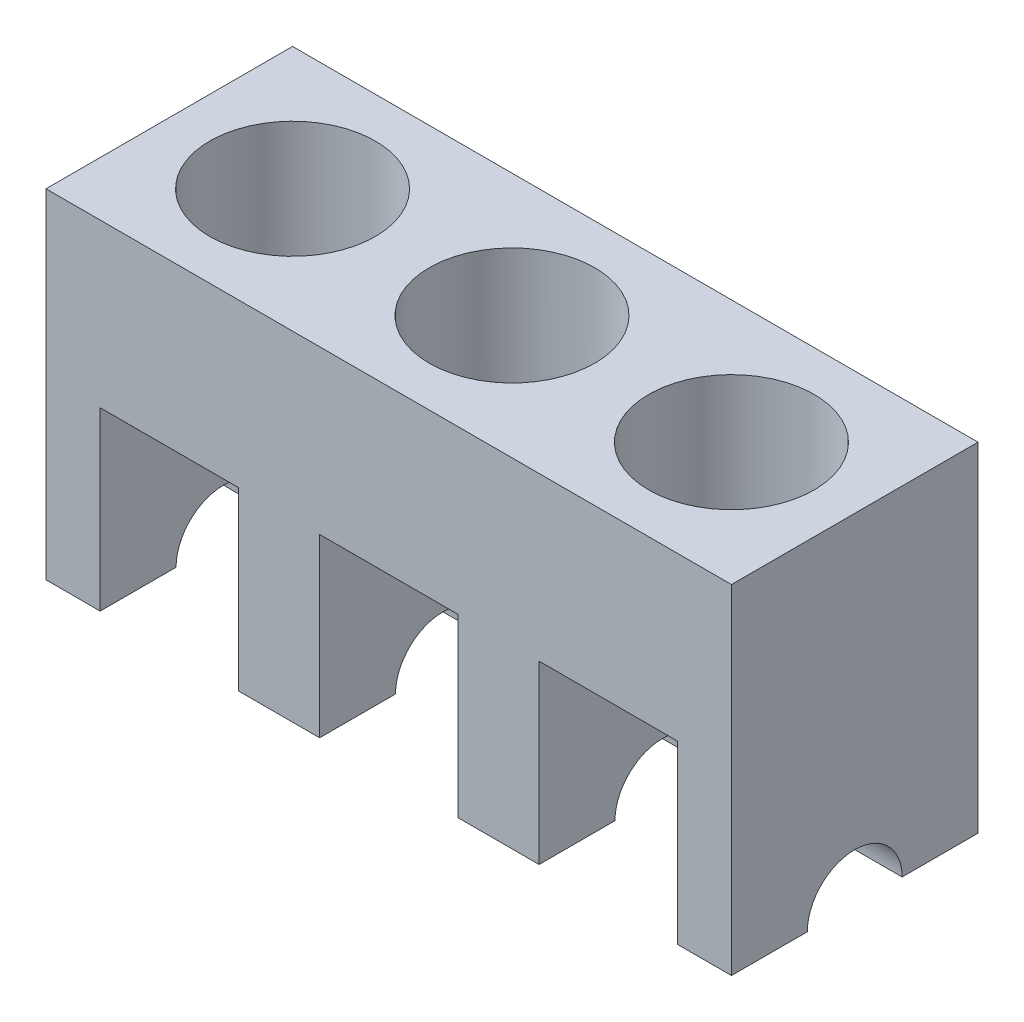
ISO-10303-21;
HEADER;
FILE_DESCRIPTION(('STEP AP214'),'2;1');
FILE_NAME('part.step','',(''),(''),'','','');
FILE_SCHEMA(('AUTOMOTIVE_DESIGN { 1 0 10303 214 1 1 1 1 }'));
ENDSEC;
DATA;
#1=APPLICATION_CONTEXT('core data for automotive mechanical design processes');
#2=APPLICATION_PROTOCOL_DEFINITION('international standard','automotive_design',2000,#1);
#3=PRODUCT_CONTEXT('',#1,'mechanical');
#4=PRODUCT('Part','Part','',(#3));
#5=PRODUCT_RELATED_PRODUCT_CATEGORY('part','',(#4));
#6=PRODUCT_DEFINITION_FORMATION('','',#4);
#7=PRODUCT_DEFINITION_CONTEXT('part definition',#1,'design');
#8=PRODUCT_DEFINITION('design','',#6,#7);
#9=PRODUCT_DEFINITION_SHAPE('','',#8);
#10=(LENGTH_UNIT() NAMED_UNIT(*) SI_UNIT(.MILLI.,.METRE.));
#11=(NAMED_UNIT(*) PLANE_ANGLE_UNIT() SI_UNIT($,.RADIAN.));
#12=(NAMED_UNIT(*) SI_UNIT($,.STERADIAN.) SOLID_ANGLE_UNIT());
#13=UNCERTAINTY_MEASURE_WITH_UNIT(LENGTH_MEASURE(1.E-05),#10,'distance_accuracy_value','');
#14=(GEOMETRIC_REPRESENTATION_CONTEXT(3) GLOBAL_UNCERTAINTY_ASSIGNED_CONTEXT((#13)) GLOBAL_UNIT_ASSIGNED_CONTEXT((#10,
#11,#12)) REPRESENTATION_CONTEXT('',''));
#15=CARTESIAN_POINT('',(0.,0.,0.));
#16=DIRECTION('',(0.,0.,1.));
#17=DIRECTION('',(1.,0.,0.));
#18=AXIS2_PLACEMENT_3D('',#15,#16,#17);
#19=CARTESIAN_POINT('',(0.,0.,0.));
#20=DIRECTION('',(0.,1.,0.));
#21=DIRECTION('',(0.,0.,1.));
#22=AXIS2_PLACEMENT_3D('',#19,#20,#21);
#23=PLANE('',#22);
#24=DIRECTION('',(0.,0.,-1.));
#25=VECTOR('',#24,1.);
#26=CARTESIAN_POINT('',(-55.5,0.,0.));
#27=LINE('',#26,#25);
#28=CARTESIAN_POINT('',(-55.5,0.,45.5));
#29=VERTEX_POINT('',#28);
#30=CARTESIAN_POINT('',(-55.5,0.,17.5));
#31=VERTEX_POINT('',#30);
#32=EDGE_CURVE('E421',#29,#31,#27,.T.);
#33=ORIENTED_EDGE('',*,*,#32,.T.);
#34=DIRECTION('',(1.,0.,0.));
#35=VECTOR('',#34,1.);
#36=CARTESIAN_POINT('',(-126.5,0.,17.5));
#37=LINE('',#36,#35);
#38=CARTESIAN_POINT('',(-25.5,0.,17.5));
#39=VERTEX_POINT('',#38);
#40=EDGE_CURVE('E623',#31,#39,#37,.T.);
#41=ORIENTED_EDGE('',*,*,#40,.T.);
#42=DIRECTION('',(0.,0.,1.));
#43=VECTOR('',#42,1.);
#44=CARTESIAN_POINT('',(-25.5,0.,0.));
#45=LINE('',#44,#43);
#46=CARTESIAN_POINT('',(-25.5,0.,45.5));
#47=VERTEX_POINT('',#46);
#48=EDGE_CURVE('E430',#39,#47,#45,.T.);
#49=ORIENTED_EDGE('',*,*,#48,.T.);
#50=DIRECTION('',(1.,0.,0.));
#51=VECTOR('',#50,1.);
#52=CARTESIAN_POINT('',(-126.5,0.,45.5));
#53=LINE('',#52,#51);
#54=EDGE_CURVE('E299',#29,#47,#53,.T.);
#55=ORIENTED_EDGE('',*,*,#54,.F.);
#56=EDGE_LOOP('',(#33,#41,#49,#55));
#57=FACE_BOUND('',#56,.T.);
#58=ADVANCED_FACE('F33',(#57),#23,.F.);
#59=DIRECTION('',(0.,0.,-1.));
#60=VECTOR('',#59,1.);
#61=CARTESIAN_POINT('',(106.5,0.,0.));
#62=LINE('',#61,#60);
#63=CARTESIAN_POINT('',(106.5,0.,45.5));
#64=VERTEX_POINT('',#63);
#65=CARTESIAN_POINT('',(106.5,0.,17.5));
#66=VERTEX_POINT('',#65);
#67=EDGE_CURVE('E455',#64,#66,#62,.T.);
#68=ORIENTED_EDGE('',*,*,#67,.T.);
#69=DIRECTION('',(1.,0.,0.));
#70=VECTOR('',#69,1.);
#71=CARTESIAN_POINT('',(-126.5,0.,17.5));
#72=LINE('',#71,#70);
#73=CARTESIAN_POINT('',(126.5,0.,17.5));
#74=VERTEX_POINT('',#73);
#75=EDGE_CURVE('E617',#66,#74,#72,.T.);
#76=ORIENTED_EDGE('',*,*,#75,.T.);
#77=DIRECTION('',(0.,0.,-1.));
#78=VECTOR('',#77,1.);
#79=CARTESIAN_POINT('',(126.5,0.,-45.5));
#80=LINE('',#79,#78);
#81=CARTESIAN_POINT('',(126.5,0.,45.5));
#82=VERTEX_POINT('',#81);
#83=EDGE_CURVE('E476',#82,#74,#80,.T.);
#84=ORIENTED_EDGE('',*,*,#83,.F.);
#85=EDGE_CURVE('E287',#64,#82,#53,.T.);
#86=ORIENTED_EDGE('',*,*,#85,.F.);
#87=EDGE_LOOP('',(#68,#76,#84,#86));
#88=FACE_BOUND('',#87,.T.);
#89=ADVANCED_FACE('F579',(#88),#23,.F.);
#90=DIRECTION('',(0.,0.,-1.));
#91=VECTOR('',#90,1.);
#92=CARTESIAN_POINT('',(25.5,0.,0.));
#93=LINE('',#92,#91);
#94=CARTESIAN_POINT('',(25.5,0.,45.5));
#95=VERTEX_POINT('',#94);
#96=CARTESIAN_POINT('',(25.5,0.,17.5));
#97=VERTEX_POINT('',#96);
#98=EDGE_CURVE('E441',#95,#97,#93,.T.);
#99=ORIENTED_EDGE('',*,*,#98,.T.);
#100=DIRECTION('',(1.,0.,0.));
#101=VECTOR('',#100,1.);
#102=CARTESIAN_POINT('',(-126.5,0.,17.5));
#103=LINE('',#102,#101);
#104=CARTESIAN_POINT('',(55.5,0.,17.5));
#105=VERTEX_POINT('',#104);
#106=EDGE_CURVE('E604',#97,#105,#103,.T.);
#107=ORIENTED_EDGE('',*,*,#106,.T.);
#108=DIRECTION('',(0.,0.,1.));
#109=VECTOR('',#108,1.);
#110=CARTESIAN_POINT('',(55.5,0.,0.));
#111=LINE('',#110,#109);
#112=CARTESIAN_POINT('',(55.5,0.,45.5));
#113=VERTEX_POINT('',#112);
#114=EDGE_CURVE('E447',#105,#113,#111,.T.);
#115=ORIENTED_EDGE('',*,*,#114,.T.);
#116=EDGE_CURVE('E290',#95,#113,#53,.T.);
#117=ORIENTED_EDGE('',*,*,#116,.F.);
#118=EDGE_LOOP('',(#99,#107,#115,#117));
#119=FACE_BOUND('',#118,.T.);
#120=ADVANCED_FACE('F585',(#119),#23,.F.);
#121=DIRECTION('',(0.,0.,1.));
#122=VECTOR('',#121,1.);
#123=CARTESIAN_POINT('',(-126.5,0.,-45.5));
#124=LINE('',#123,#122);
#125=CARTESIAN_POINT('',(-126.5,0.,17.5));
#126=VERTEX_POINT('',#125);
#127=CARTESIAN_POINT('',(-126.5,0.,45.5));
#128=VERTEX_POINT('',#127);
#129=EDGE_CURVE('E288',#126,#128,#124,.T.);
#130=ORIENTED_EDGE('',*,*,#129,.F.);
#131=DIRECTION('',(1.,0.,0.));
#132=VECTOR('',#131,1.);
#133=CARTESIAN_POINT('',(-126.5,0.,17.5));
#134=LINE('',#133,#132);
#135=CARTESIAN_POINT('',(-106.5,0.,17.5));
#136=VERTEX_POINT('',#135);
#137=EDGE_CURVE('E267',#126,#136,#134,.T.);
#138=ORIENTED_EDGE('',*,*,#137,.T.);
#139=DIRECTION('',(0.,0.,1.));
#140=VECTOR('',#139,1.);
#141=CARTESIAN_POINT('',(-106.5,0.,0.));
#142=LINE('',#141,#140);
#143=CARTESIAN_POINT('',(-106.5,0.,45.5));
#144=VERTEX_POINT('',#143);
#145=EDGE_CURVE('E412',#136,#144,#142,.T.);
#146=ORIENTED_EDGE('',*,*,#145,.T.);
#147=EDGE_CURVE('E292',#128,#144,#53,.T.);
#148=ORIENTED_EDGE('',*,*,#147,.F.);
#149=EDGE_LOOP('',(#130,#138,#146,#148));
#150=FACE_BOUND('',#149,.T.);
#151=ADVANCED_FACE('F675',(#150),#23,.F.);
#152=CARTESIAN_POINT('',(-25.5,0.,-45.5));
#153=VERTEX_POINT('',#152);
#154=CARTESIAN_POINT('',(-25.5,0.,-17.5));
#155=VERTEX_POINT('',#154);
#156=EDGE_CURVE('E431',#153,#155,#45,.T.);
#157=ORIENTED_EDGE('',*,*,#156,.T.);
#158=DIRECTION('',(1.,0.,0.));
#159=VECTOR('',#158,1.);
#160=CARTESIAN_POINT('',(-126.5,0.,-17.5));
#161=LINE('',#160,#159);
#162=CARTESIAN_POINT('',(-55.5,0.,-17.5));
#163=VERTEX_POINT('',#162);
#164=EDGE_CURVE('E56',#155,#163,#161,.F.);
#165=ORIENTED_EDGE('',*,*,#164,.T.);
#166=CARTESIAN_POINT('',(-55.5,0.,-45.5));
#167=VERTEX_POINT('',#166);
#168=EDGE_CURVE('E420',#163,#167,#27,.T.);
#169=ORIENTED_EDGE('',*,*,#168,.T.);
#170=DIRECTION('',(-1.,0.,0.));
#171=VECTOR('',#170,1.);
#172=CARTESIAN_POINT('',(-126.5,0.,-45.5));
#173=LINE('',#172,#171);
#174=EDGE_CURVE('E483',#153,#167,#173,.T.);
#175=ORIENTED_EDGE('',*,*,#174,.F.);
#176=EDGE_LOOP('',(#157,#165,#169,#175));
#177=FACE_BOUND('',#176,.T.);
#178=ADVANCED_FACE('F509',(#177),#23,.F.);
#179=CARTESIAN_POINT('',(126.5,0.,-17.5));
#180=VERTEX_POINT('',#179);
#181=CARTESIAN_POINT('',(126.5,0.,-45.5));
#182=VERTEX_POINT('',#181);
#183=EDGE_CURVE('E313',#180,#182,#80,.T.);
#184=ORIENTED_EDGE('',*,*,#183,.F.);
#185=DIRECTION('',(1.,0.,0.));
#186=VECTOR('',#185,1.);
#187=CARTESIAN_POINT('',(-126.5,0.,-17.5));
#188=LINE('',#187,#186);
#189=CARTESIAN_POINT('',(106.5,0.,-17.5));
#190=VERTEX_POINT('',#189);
#191=EDGE_CURVE('E615',#180,#190,#188,.F.);
#192=ORIENTED_EDGE('',*,*,#191,.T.);
#193=CARTESIAN_POINT('',(106.5,0.,-45.5));
#194=VERTEX_POINT('',#193);
#195=EDGE_CURVE('E454',#190,#194,#62,.T.);
#196=ORIENTED_EDGE('',*,*,#195,.T.);
#197=EDGE_CURVE('E293',#182,#194,#173,.T.);
#198=ORIENTED_EDGE('',*,*,#197,.F.);
#199=EDGE_LOOP('',(#184,#192,#196,#198));
#200=FACE_BOUND('',#199,.T.);
#201=ADVANCED_FACE('F496',(#200),#23,.F.);
#202=CARTESIAN_POINT('',(55.5,0.,-45.5));
#203=VERTEX_POINT('',#202);
#204=CARTESIAN_POINT('',(55.5,0.,-17.5));
#205=VERTEX_POINT('',#204);
#206=EDGE_CURVE('E448',#203,#205,#111,.T.);
#207=ORIENTED_EDGE('',*,*,#206,.T.);
#208=DIRECTION('',(1.,0.,0.));
#209=VECTOR('',#208,1.);
#210=CARTESIAN_POINT('',(-126.5,0.,-17.5));
#211=LINE('',#210,#209);
#212=CARTESIAN_POINT('',(25.5,0.,-17.5));
#213=VERTEX_POINT('',#212);
#214=EDGE_CURVE('E271',#205,#213,#211,.F.);
#215=ORIENTED_EDGE('',*,*,#214,.T.);
#216=CARTESIAN_POINT('',(25.5,0.,-45.5));
#217=VERTEX_POINT('',#216);
#218=EDGE_CURVE('E440',#213,#217,#93,.T.);
#219=ORIENTED_EDGE('',*,*,#218,.T.);
#220=EDGE_CURVE('E499',#203,#217,#173,.T.);
#221=ORIENTED_EDGE('',*,*,#220,.F.);
#222=EDGE_LOOP('',(#207,#215,#219,#221));
#223=FACE_BOUND('',#222,.T.);
#224=ADVANCED_FACE('F576',(#223),#23,.F.);
#225=CARTESIAN_POINT('',(81.,44.,0.));
#226=DIRECTION('',(0.,1.,0.));
#227=DIRECTION('',(0.,0.,1.));
#228=AXIS2_PLACEMENT_3D('',#225,#226,#227);
#229=PLANE('',#228);
#230=DIRECTION('',(0.,0.,-1.));
#231=VECTOR('',#230,1.);
#232=CARTESIAN_POINT('',(106.5,44.,0.));
#233=LINE('',#232,#231);
#234=CARTESIAN_POINT('',(106.5,44.,16.8241641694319));
#235=VERTEX_POINT('',#234);
#236=CARTESIAN_POINT('',(106.5,44.,-16.824164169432));
#237=VERTEX_POINT('',#236);
#238=EDGE_CURVE('E338',#235,#237,#233,.T.);
#239=ORIENTED_EDGE('',*,*,#238,.F.);
#240=CARTESIAN_POINT('',(81.,44.,0.));
#241=DIRECTION('',(0.,1.,0.));
#242=DIRECTION('',(0.,0.,1.));
#243=AXIS2_PLACEMENT_3D('',#240,#241,#242);
#244=CIRCLE('',#243,30.55);
#245=EDGE_CURVE('E472',#235,#237,#244,.T.);
#246=ORIENTED_EDGE('',*,*,#245,.T.);
#247=EDGE_LOOP('',(#239,#246));
#248=FACE_BOUND('',#247,.T.);
#249=ADVANCED_FACE('F564',(#248),#229,.T.);
#250=CARTESIAN_POINT('',(0.,44.,0.));
#251=DIRECTION('',(0.,1.,0.));
#252=DIRECTION('',(0.,0.,1.));
#253=AXIS2_PLACEMENT_3D('',#250,#251,#252);
#254=PLANE('',#253);
#255=DIRECTION('',(0.,0.,-1.));
#256=VECTOR('',#255,1.);
#257=CARTESIAN_POINT('',(25.5,44.,0.));
#258=LINE('',#257,#256);
#259=CARTESIAN_POINT('',(25.5,44.,16.824164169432));
#260=VERTEX_POINT('',#259);
#261=CARTESIAN_POINT('',(25.5,44.,-16.824164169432));
#262=VERTEX_POINT('',#261);
#263=EDGE_CURVE('E330',#260,#262,#258,.T.);
#264=ORIENTED_EDGE('',*,*,#263,.F.);
#265=CARTESIAN_POINT('',(0.,44.,0.));
#266=DIRECTION('',(0.,1.,0.));
#267=DIRECTION('',(0.,0.,1.));
#268=AXIS2_PLACEMENT_3D('',#265,#266,#267);
#269=CIRCLE('',#268,30.55);
#270=EDGE_CURVE('E465',#260,#262,#269,.T.);
#271=ORIENTED_EDGE('',*,*,#270,.T.);
#272=EDGE_LOOP('',(#264,#271));
#273=FACE_BOUND('',#272,.T.);
#274=ADVANCED_FACE('F575',(#273),#254,.T.);
#275=CARTESIAN_POINT('',(-81.,44.,0.));
#276=DIRECTION('',(0.,1.,0.));
#277=DIRECTION('',(0.,0.,1.));
#278=AXIS2_PLACEMENT_3D('',#275,#276,#277);
#279=PLANE('',#278);
#280=DIRECTION('',(0.,0.,-1.));
#281=VECTOR('',#280,1.);
#282=CARTESIAN_POINT('',(-55.5,44.,0.));
#283=LINE('',#282,#281);
#284=CARTESIAN_POINT('',(-55.5,44.,16.824164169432));
#285=VERTEX_POINT('',#284);
#286=CARTESIAN_POINT('',(-55.5,44.,-16.824164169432));
#287=VERTEX_POINT('',#286);
#288=EDGE_CURVE('E322',#285,#287,#283,.T.);
#289=ORIENTED_EDGE('',*,*,#288,.F.);
#290=CARTESIAN_POINT('',(-81.,44.,0.));
#291=DIRECTION('',(0.,1.,0.));
#292=DIRECTION('',(0.,0.,1.));
#293=AXIS2_PLACEMENT_3D('',#290,#291,#292);
#294=CIRCLE('',#293,30.55);
#295=EDGE_CURVE('E304',#285,#287,#294,.T.);
#296=ORIENTED_EDGE('',*,*,#295,.T.);
#297=EDGE_LOOP('',(#289,#296));
#298=FACE_BOUND('',#297,.T.);
#299=ADVANCED_FACE('F654',(#298),#279,.T.);
#300=CARTESIAN_POINT('',(126.5,0.,-45.5));
#301=DIRECTION('',(1.,0.,0.));
#302=DIRECTION('',(0.,0.,-1.));
#303=AXIS2_PLACEMENT_3D('',#300,#301,#302);
#304=PLANE('',#303);
#305=CARTESIAN_POINT('',(126.5,0.,0.));
#306=DIRECTION('',(1.,0.,0.));
#307=DIRECTION('',(0.,0.,-1.));
#308=AXIS2_PLACEMENT_3D('',#305,#306,#307);
#309=CIRCLE('',#308,17.5);
#310=EDGE_CURVE('E272',#180,#74,#309,.T.);
#311=ORIENTED_EDGE('',*,*,#310,.F.);
#312=ORIENTED_EDGE('',*,*,#183,.T.);
#313=DIRECTION('',(0.,1.,0.));
#314=VECTOR('',#313,1.);
#315=CARTESIAN_POINT('',(126.5,0.,-45.5));
#316=LINE('',#315,#314);
#317=CARTESIAN_POINT('',(126.5,125.,-45.5));
#318=VERTEX_POINT('',#317);
#319=EDGE_CURVE('E298',#182,#318,#316,.T.);
#320=ORIENTED_EDGE('',*,*,#319,.T.);
#321=DIRECTION('',(0.,0.,-1.));
#322=VECTOR('',#321,1.);
#323=CARTESIAN_POINT('',(126.5,125.,-45.5));
#324=LINE('',#323,#322);
#325=CARTESIAN_POINT('',(126.5,125.,45.5));
#326=VERTEX_POINT('',#325);
#327=EDGE_CURVE('E300',#326,#318,#324,.T.);
#328=ORIENTED_EDGE('',*,*,#327,.F.);
#329=DIRECTION('',(0.,1.,0.));
#330=VECTOR('',#329,1.);
#331=CARTESIAN_POINT('',(126.5,0.,45.5));
#332=LINE('',#331,#330);
#333=EDGE_CURVE('E314',#82,#326,#332,.T.);
#334=ORIENTED_EDGE('',*,*,#333,.F.);
#335=ORIENTED_EDGE('',*,*,#83,.T.);
#336=EDGE_LOOP('',(#311,#312,#320,#328,#334,#335));
#337=FACE_BOUND('',#336,.T.);
#338=ADVANCED_FACE('F35',(#337),#304,.T.);
#339=CARTESIAN_POINT('',(-126.5,0.,45.5));
#340=DIRECTION('',(0.,0.,1.));
#341=DIRECTION('',(1.,0.,0.));
#342=AXIS2_PLACEMENT_3D('',#339,#340,#341);
#343=PLANE('',#342);
#344=DIRECTION('',(0.,1.,0.));
#345=VECTOR('',#344,1.);
#346=CARTESIAN_POINT('',(-55.5,65.,45.5));
#347=LINE('',#346,#345);
#348=CARTESIAN_POINT('',(-55.5,65.,45.5));
#349=VERTEX_POINT('',#348);
#350=EDGE_CURVE('E369',#29,#349,#347,.T.);
#351=ORIENTED_EDGE('',*,*,#350,.F.);
#352=ORIENTED_EDGE('',*,*,#54,.T.);
#353=DIRECTION('',(0.,-1.,0.));
#354=VECTOR('',#353,1.);
#355=CARTESIAN_POINT('',(-25.5,65.,45.5));
#356=LINE('',#355,#354);
#357=CARTESIAN_POINT('',(-25.5,65.,45.5));
#358=VERTEX_POINT('',#357);
#359=EDGE_CURVE('E384',#358,#47,#356,.T.);
#360=ORIENTED_EDGE('',*,*,#359,.F.);
#361=DIRECTION('',(-1.,0.,0.));
#362=VECTOR('',#361,1.);
#363=CARTESIAN_POINT('',(-25.5,65.,45.5));
#364=LINE('',#363,#362);
#365=CARTESIAN_POINT('',(25.5,65.,45.5));
#366=VERTEX_POINT('',#365);
#367=EDGE_CURVE('E381',#366,#358,#364,.T.);
#368=ORIENTED_EDGE('',*,*,#367,.F.);
#369=DIRECTION('',(0.,1.,0.));
#370=VECTOR('',#369,1.);
#371=CARTESIAN_POINT('',(25.5,65.,45.5));
#372=LINE('',#371,#370);
#373=EDGE_CURVE('E379',#95,#366,#372,.T.);
#374=ORIENTED_EDGE('',*,*,#373,.F.);
#375=ORIENTED_EDGE('',*,*,#116,.T.);
#376=DIRECTION('',(0.,-1.,0.));
#377=VECTOR('',#376,1.);
#378=CARTESIAN_POINT('',(55.5,65.,45.5));
#379=LINE('',#378,#377);
#380=CARTESIAN_POINT('',(55.5,65.,45.5));
#381=VERTEX_POINT('',#380);
#382=EDGE_CURVE('E537',#381,#113,#379,.T.);
#383=ORIENTED_EDGE('',*,*,#382,.F.);
#384=DIRECTION('',(-1.,0.,0.));
#385=VECTOR('',#384,1.);
#386=CARTESIAN_POINT('',(55.5,65.,45.5));
#387=LINE('',#386,#385);
#388=CARTESIAN_POINT('',(106.5,65.,45.5));
#389=VERTEX_POINT('',#388);
#390=EDGE_CURVE('E534',#389,#381,#387,.T.);
#391=ORIENTED_EDGE('',*,*,#390,.F.);
#392=DIRECTION('',(0.,1.,0.));
#393=VECTOR('',#392,1.);
#394=CARTESIAN_POINT('',(106.5,65.,45.5));
#395=LINE('',#394,#393);
#396=EDGE_CURVE('E400',#64,#389,#395,.T.);
#397=ORIENTED_EDGE('',*,*,#396,.F.);
#398=ORIENTED_EDGE('',*,*,#85,.T.);
#399=ORIENTED_EDGE('',*,*,#333,.T.);
#400=DIRECTION('',(1.,0.,0.));
#401=VECTOR('',#400,1.);
#402=CARTESIAN_POINT('',(-126.5,125.,45.5));
#403=LINE('',#402,#401);
#404=CARTESIAN_POINT('',(-126.5,125.,45.5));
#405=VERTEX_POINT('',#404);
#406=EDGE_CURVE('E310',#405,#326,#403,.T.);
#407=ORIENTED_EDGE('',*,*,#406,.F.);
#408=DIRECTION('',(0.,1.,0.));
#409=VECTOR('',#408,1.);
#410=CARTESIAN_POINT('',(-126.5,0.,45.5));
#411=LINE('',#410,#409);
#412=EDGE_CURVE('E317',#128,#405,#411,.T.);
#413=ORIENTED_EDGE('',*,*,#412,.F.);
#414=ORIENTED_EDGE('',*,*,#147,.T.);
#415=DIRECTION('',(0.,-1.,0.));
#416=VECTOR('',#415,1.);
#417=CARTESIAN_POINT('',(-106.5,65.,45.5));
#418=LINE('',#417,#416);
#419=CARTESIAN_POINT('',(-106.5,65.,45.5));
#420=VERTEX_POINT('',#419);
#421=EDGE_CURVE('E518',#420,#144,#418,.T.);
#422=ORIENTED_EDGE('',*,*,#421,.F.);
#423=DIRECTION('',(-1.,0.,0.));
#424=VECTOR('',#423,1.);
#425=CARTESIAN_POINT('',(-106.5,65.,45.5));
#426=LINE('',#425,#424);
#427=EDGE_CURVE('E372',#349,#420,#426,.T.);
#428=ORIENTED_EDGE('',*,*,#427,.F.);
#429=EDGE_LOOP('',(#351,#352,#360,#368,#374,#375,#383,#391,#397,#398,#399,#407,#413,#414,#422,#428));
#430=FACE_BOUND('',#429,.T.);
#431=ADVANCED_FACE('F553',(#430),#343,.T.);
#432=CARTESIAN_POINT('',(-126.5,0.,-45.5));
#433=DIRECTION('',(-1.,0.,0.));
#434=DIRECTION('',(0.,0.,1.));
#435=AXIS2_PLACEMENT_3D('',#432,#433,#434);
#436=PLANE('',#435);
#437=CARTESIAN_POINT('',(-126.5,0.,0.));
#438=DIRECTION('',(1.,0.,0.));
#439=DIRECTION('',(0.,0.,-1.));
#440=AXIS2_PLACEMENT_3D('',#437,#438,#439);
#441=CIRCLE('',#440,17.5);
#442=CARTESIAN_POINT('',(-126.5,0.,-17.5));
#443=VERTEX_POINT('',#442);
#444=EDGE_CURVE('E264',#443,#126,#441,.T.);
#445=ORIENTED_EDGE('',*,*,#444,.T.);
#446=ORIENTED_EDGE('',*,*,#129,.T.);
#447=ORIENTED_EDGE('',*,*,#412,.T.);
#448=DIRECTION('',(0.,0.,1.));
#449=VECTOR('',#448,1.);
#450=CARTESIAN_POINT('',(-126.5,125.,-45.5));
#451=LINE('',#450,#449);
#452=CARTESIAN_POINT('',(-126.5,125.,-45.5));
#453=VERTEX_POINT('',#452);
#454=EDGE_CURVE('E307',#453,#405,#451,.T.);
#455=ORIENTED_EDGE('',*,*,#454,.F.);
#456=DIRECTION('',(0.,1.,0.));
#457=VECTOR('',#456,1.);
#458=CARTESIAN_POINT('',(-126.5,0.,-45.5));
#459=LINE('',#458,#457);
#460=CARTESIAN_POINT('',(-126.5,0.,-45.5));
#461=VERTEX_POINT('',#460);
#462=EDGE_CURVE('E286',#461,#453,#459,.T.);
#463=ORIENTED_EDGE('',*,*,#462,.F.);
#464=EDGE_CURVE('E279',#461,#443,#124,.T.);
#465=ORIENTED_EDGE('',*,*,#464,.T.);
#466=EDGE_LOOP('',(#445,#446,#447,#455,#463,#465));
#467=FACE_BOUND('',#466,.T.);
#468=ADVANCED_FACE('F284',(#467),#436,.T.);
#469=CARTESIAN_POINT('',(-126.5,0.,-45.5));
#470=DIRECTION('',(0.,0.,-1.));
#471=DIRECTION('',(-1.,0.,0.));
#472=AXIS2_PLACEMENT_3D('',#469,#470,#471);
#473=PLANE('',#472);
#474=DIRECTION('',(0.,1.,0.));
#475=VECTOR('',#474,1.);
#476=CARTESIAN_POINT('',(-55.5,65.,-45.5));
#477=LINE('',#476,#475);
#478=CARTESIAN_POINT('',(-55.5,65.,-45.5));
#479=VERTEX_POINT('',#478);
#480=EDGE_CURVE('E506',#167,#479,#477,.T.);
#481=ORIENTED_EDGE('',*,*,#480,.T.);
#482=DIRECTION('',(-1.,0.,0.));
#483=VECTOR('',#482,1.);
#484=CARTESIAN_POINT('',(-106.5,65.,-45.5));
#485=LINE('',#484,#483);
#486=CARTESIAN_POINT('',(-106.5,65.,-45.5));
#487=VERTEX_POINT('',#486);
#488=EDGE_CURVE('E517',#479,#487,#485,.T.);
#489=ORIENTED_EDGE('',*,*,#488,.T.);
#490=DIRECTION('',(0.,-1.,0.));
#491=VECTOR('',#490,1.);
#492=CARTESIAN_POINT('',(-106.5,65.,-45.5));
#493=LINE('',#492,#491);
#494=CARTESIAN_POINT('',(-106.5,0.,-45.5));
#495=VERTEX_POINT('',#494);
#496=EDGE_CURVE('E520',#487,#495,#493,.T.);
#497=ORIENTED_EDGE('',*,*,#496,.T.);
#498=EDGE_CURVE('E478',#495,#461,#173,.T.);
#499=ORIENTED_EDGE('',*,*,#498,.T.);
#500=ORIENTED_EDGE('',*,*,#462,.T.);
#501=DIRECTION('',(-1.,0.,0.));
#502=VECTOR('',#501,1.);
#503=CARTESIAN_POINT('',(-126.5,125.,-45.5));
#504=LINE('',#503,#502);
#505=EDGE_CURVE('E303',#318,#453,#504,.T.);
#506=ORIENTED_EDGE('',*,*,#505,.F.);
#507=ORIENTED_EDGE('',*,*,#319,.F.);
#508=ORIENTED_EDGE('',*,*,#197,.T.);
#509=DIRECTION('',(0.,1.,0.));
#510=VECTOR('',#509,1.);
#511=CARTESIAN_POINT('',(106.5,65.,-45.5));
#512=LINE('',#511,#510);
#513=CARTESIAN_POINT('',(106.5,65.,-45.5));
#514=VERTEX_POINT('',#513);
#515=EDGE_CURVE('E540',#194,#514,#512,.T.);
#516=ORIENTED_EDGE('',*,*,#515,.T.);
#517=DIRECTION('',(-1.,0.,0.));
#518=VECTOR('',#517,1.);
#519=CARTESIAN_POINT('',(55.5,65.,-45.5));
#520=LINE('',#519,#518);
#521=CARTESIAN_POINT('',(55.5,65.,-45.5));
#522=VERTEX_POINT('',#521);
#523=EDGE_CURVE('E541',#514,#522,#520,.T.);
#524=ORIENTED_EDGE('',*,*,#523,.T.);
#525=DIRECTION('',(0.,-1.,0.));
#526=VECTOR('',#525,1.);
#527=CARTESIAN_POINT('',(55.5,65.,-45.5));
#528=LINE('',#527,#526);
#529=EDGE_CURVE('E367',#522,#203,#528,.T.);
#530=ORIENTED_EDGE('',*,*,#529,.T.);
#531=ORIENTED_EDGE('',*,*,#220,.T.);
#532=DIRECTION('',(0.,1.,0.));
#533=VECTOR('',#532,1.);
#534=CARTESIAN_POINT('',(25.5,65.,-45.5));
#535=LINE('',#534,#533);
#536=CARTESIAN_POINT('',(25.5,65.,-45.5));
#537=VERTEX_POINT('',#536);
#538=EDGE_CURVE('E387',#217,#537,#535,.T.);
#539=ORIENTED_EDGE('',*,*,#538,.T.);
#540=DIRECTION('',(-1.,0.,0.));
#541=VECTOR('',#540,1.);
#542=CARTESIAN_POINT('',(-25.5,65.,-45.5));
#543=LINE('',#542,#541);
#544=CARTESIAN_POINT('',(-25.5,65.,-45.5));
#545=VERTEX_POINT('',#544);
#546=EDGE_CURVE('E390',#537,#545,#543,.T.);
#547=ORIENTED_EDGE('',*,*,#546,.T.);
#548=DIRECTION('',(0.,-1.,0.));
#549=VECTOR('',#548,1.);
#550=CARTESIAN_POINT('',(-25.5,65.,-45.5));
#551=LINE('',#550,#549);
#552=EDGE_CURVE('E393',#545,#153,#551,.T.);
#553=ORIENTED_EDGE('',*,*,#552,.T.);
#554=ORIENTED_EDGE('',*,*,#174,.T.);
#555=EDGE_LOOP('',(#481,#489,#497,#499,#500,#506,#507,#508,#516,#524,#530,#531,#539,#547,#553,#554));
#556=FACE_BOUND('',#555,.T.);
#557=ADVANCED_FACE('F494',(#556),#473,.T.);
#558=CARTESIAN_POINT('',(-106.5,0.,-17.5));
#559=VERTEX_POINT('',#558);
#560=EDGE_CURVE('E280',#495,#559,#142,.T.);
#561=ORIENTED_EDGE('',*,*,#560,.T.);
#562=DIRECTION('',(1.,0.,0.));
#563=VECTOR('',#562,1.);
#564=CARTESIAN_POINT('',(-126.5,0.,-17.5));
#565=LINE('',#564,#563);
#566=EDGE_CURVE('E48',#559,#443,#565,.F.);
#567=ORIENTED_EDGE('',*,*,#566,.T.);
#568=ORIENTED_EDGE('',*,*,#464,.F.);
#569=ORIENTED_EDGE('',*,*,#498,.F.);
#570=EDGE_LOOP('',(#561,#567,#568,#569));
#571=FACE_BOUND('',#570,.T.);
#572=ADVANCED_FACE('F277',(#571),#23,.F.);
#573=CARTESIAN_POINT('',(0.,125.,0.));
#574=DIRECTION('',(0.,1.,0.));
#575=DIRECTION('',(0.,0.,1.));
#576=AXIS2_PLACEMENT_3D('',#573,#574,#575);
#577=PLANE('',#576);
#578=CARTESIAN_POINT('',(-81.,125.,0.));
#579=DIRECTION('',(0.,1.,0.));
#580=DIRECTION('',(0.,0.,1.));
#581=AXIS2_PLACEMENT_3D('',#578,#579,#580);
#582=CIRCLE('',#581,30.55);
#583=CARTESIAN_POINT('',(-81.,125.,30.55));
#584=VERTEX_POINT('',#583);
#585=EDGE_CURVE('E462',#584,#584,#582,.T.);
#586=ORIENTED_EDGE('',*,*,#585,.F.);
#587=EDGE_LOOP('',(#586));
#588=FACE_BOUND('',#587,.T.);
#589=CARTESIAN_POINT('',(0.,125.,0.));
#590=DIRECTION('',(0.,1.,0.));
#591=DIRECTION('',(0.,0.,1.));
#592=AXIS2_PLACEMENT_3D('',#589,#590,#591);
#593=CIRCLE('',#592,30.55);
#594=CARTESIAN_POINT('',(0.,125.,30.55));
#595=VERTEX_POINT('',#594);
#596=EDGE_CURVE('E469',#595,#595,#593,.T.);
#597=ORIENTED_EDGE('',*,*,#596,.F.);
#598=EDGE_LOOP('',(#597));
#599=FACE_BOUND('',#598,.T.);
#600=CARTESIAN_POINT('',(81.,125.,0.));
#601=DIRECTION('',(0.,1.,0.));
#602=DIRECTION('',(0.,0.,1.));
#603=AXIS2_PLACEMENT_3D('',#600,#601,#602);
#604=CIRCLE('',#603,30.55);
#605=CARTESIAN_POINT('',(81.,125.,30.55));
#606=VERTEX_POINT('',#605);
#607=EDGE_CURVE('E458',#606,#606,#604,.T.);
#608=ORIENTED_EDGE('',*,*,#607,.F.);
#609=EDGE_LOOP('',(#608));
#610=FACE_BOUND('',#609,.T.);
#611=ORIENTED_EDGE('',*,*,#327,.T.);
#612=ORIENTED_EDGE('',*,*,#505,.T.);
#613=ORIENTED_EDGE('',*,*,#454,.T.);
#614=ORIENTED_EDGE('',*,*,#406,.T.);
#615=EDGE_LOOP('',(#611,#612,#613,#614));
#616=FACE_BOUND('',#615,.T.);
#617=ADVANCED_FACE('F572',(#588,#599,#610,#616),#577,.T.);
#618=CARTESIAN_POINT('',(81.,44.,0.));
#619=DIRECTION('',(0.,1.,0.));
#620=DIRECTION('',(0.,0.,1.));
#621=AXIS2_PLACEMENT_3D('',#618,#619,#620);
#622=CYLINDRICAL_SURFACE('',#621,30.55);
#623=CARTESIAN_POINT('',(81.,65.,0.));
#624=DIRECTION('',(0.,1.,0.));
#625=DIRECTION('',(0.,0.,1.));
#626=AXIS2_PLACEMENT_3D('',#623,#624,#625);
#627=CIRCLE('',#626,30.55);
#628=CARTESIAN_POINT('',(55.5,65.,-16.8241641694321));
#629=VERTEX_POINT('',#628);
#630=CARTESIAN_POINT('',(106.5,65.,-16.824164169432));
#631=VERTEX_POINT('',#630);
#632=EDGE_CURVE('E41',#629,#631,#627,.F.);
#633=ORIENTED_EDGE('',*,*,#632,.T.);
#634=DIRECTION('',(0.,1.,0.));
#635=VECTOR('',#634,1.);
#636=CARTESIAN_POINT('',(106.5,44.,-16.824164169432));
#637=LINE('',#636,#635);
#638=EDGE_CURVE('E350',#631,#237,#637,.F.);
#639=ORIENTED_EDGE('',*,*,#638,.T.);
#640=ORIENTED_EDGE('',*,*,#245,.F.);
#641=DIRECTION('',(0.,1.,0.));
#642=VECTOR('',#641,1.);
#643=CARTESIAN_POINT('',(106.5,44.,16.8241641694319));
#644=LINE('',#643,#642);
#645=CARTESIAN_POINT('',(106.5,65.,16.8241641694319));
#646=VERTEX_POINT('',#645);
#647=EDGE_CURVE('E451',#235,#646,#644,.T.);
#648=ORIENTED_EDGE('',*,*,#647,.T.);
#649=CARTESIAN_POINT('',(55.5,65.,16.824164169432));
#650=VERTEX_POINT('',#649);
#651=EDGE_CURVE('E339',#646,#650,#627,.F.);
#652=ORIENTED_EDGE('',*,*,#651,.T.);
#653=DIRECTION('',(0.,1.,0.));
#654=VECTOR('',#653,1.);
#655=CARTESIAN_POINT('',(55.5,44.,16.824164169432));
#656=LINE('',#655,#654);
#657=CARTESIAN_POINT('',(55.5,44.,16.824164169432));
#658=VERTEX_POINT('',#657);
#659=EDGE_CURVE('E445',#650,#658,#656,.F.);
#660=ORIENTED_EDGE('',*,*,#659,.T.);
#661=CARTESIAN_POINT('',(55.5,44.,-16.8241641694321));
#662=VERTEX_POINT('',#661);
#663=EDGE_CURVE('E474',#662,#658,#244,.T.);
#664=ORIENTED_EDGE('',*,*,#663,.F.);
#665=DIRECTION('',(0.,1.,0.));
#666=VECTOR('',#665,1.);
#667=CARTESIAN_POINT('',(55.5,44.,-16.8241641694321));
#668=LINE('',#667,#666);
#669=EDGE_CURVE('E353',#662,#629,#668,.T.);
#670=ORIENTED_EDGE('',*,*,#669,.T.);
#671=EDGE_LOOP('',(#633,#639,#640,#648,#652,#660,#664,#670));
#672=FACE_BOUND('',#671,.T.);
#673=ORIENTED_EDGE('',*,*,#607,.T.);
#674=EDGE_LOOP('',(#673));
#675=FACE_BOUND('',#674,.T.);
#676=ADVANCED_FACE('F347',(#672,#675),#622,.F.);
#677=DIRECTION('',(0.,0.,1.));
#678=VECTOR('',#677,1.);
#679=CARTESIAN_POINT('',(55.5,44.,0.));
#680=LINE('',#679,#678);
#681=EDGE_CURVE('E336',#662,#658,#680,.T.);
#682=ORIENTED_EDGE('',*,*,#681,.F.);
#683=ORIENTED_EDGE('',*,*,#663,.T.);
#684=EDGE_LOOP('',(#682,#683));
#685=FACE_BOUND('',#684,.T.);
#686=ADVANCED_FACE('F560',(#685),#229,.T.);
#687=CARTESIAN_POINT('',(0.,44.,0.));
#688=DIRECTION('',(0.,1.,0.));
#689=DIRECTION('',(0.,0.,1.));
#690=AXIS2_PLACEMENT_3D('',#687,#688,#689);
#691=CYLINDRICAL_SURFACE('',#690,30.55);
#692=CARTESIAN_POINT('',(0.,65.,0.));
#693=DIRECTION('',(0.,1.,0.));
#694=DIRECTION('',(0.,0.,1.));
#695=AXIS2_PLACEMENT_3D('',#692,#693,#694);
#696=CIRCLE('',#695,30.55);
#697=CARTESIAN_POINT('',(-25.5,65.,-16.8241641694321));
#698=VERTEX_POINT('',#697);
#699=CARTESIAN_POINT('',(25.5,65.,-16.824164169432));
#700=VERTEX_POINT('',#699);
#701=EDGE_CURVE('E335',#698,#700,#696,.F.);
#702=ORIENTED_EDGE('',*,*,#701,.T.);
#703=DIRECTION('',(0.,1.,0.));
#704=VECTOR('',#703,1.);
#705=CARTESIAN_POINT('',(25.5,44.,-16.824164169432));
#706=LINE('',#705,#704);
#707=EDGE_CURVE('E437',#700,#262,#706,.F.);
#708=ORIENTED_EDGE('',*,*,#707,.T.);
#709=ORIENTED_EDGE('',*,*,#270,.F.);
#710=DIRECTION('',(0.,1.,0.));
#711=VECTOR('',#710,1.);
#712=CARTESIAN_POINT('',(25.5,44.,16.824164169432));
#713=LINE('',#712,#711);
#714=CARTESIAN_POINT('',(25.5,65.,16.824164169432));
#715=VERTEX_POINT('',#714);
#716=EDGE_CURVE('E434',#260,#715,#713,.T.);
#717=ORIENTED_EDGE('',*,*,#716,.T.);
#718=CARTESIAN_POINT('',(-25.5,65.,16.8241641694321));
#719=VERTEX_POINT('',#718);
#720=EDGE_CURVE('E332',#715,#719,#696,.F.);
#721=ORIENTED_EDGE('',*,*,#720,.T.);
#722=DIRECTION('',(0.,1.,0.));
#723=VECTOR('',#722,1.);
#724=CARTESIAN_POINT('',(-25.5,44.,16.8241641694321));
#725=LINE('',#724,#723);
#726=CARTESIAN_POINT('',(-25.5,44.,16.8241641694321));
#727=VERTEX_POINT('',#726);
#728=EDGE_CURVE('E427',#719,#727,#725,.F.);
#729=ORIENTED_EDGE('',*,*,#728,.T.);
#730=CARTESIAN_POINT('',(-25.5,44.,-16.8241641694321));
#731=VERTEX_POINT('',#730);
#732=EDGE_CURVE('E468',#731,#727,#269,.T.);
#733=ORIENTED_EDGE('',*,*,#732,.F.);
#734=DIRECTION('',(0.,1.,0.));
#735=VECTOR('',#734,1.);
#736=CARTESIAN_POINT('',(-25.5,44.,-16.8241641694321));
#737=LINE('',#736,#735);
#738=EDGE_CURVE('E424',#731,#698,#737,.T.);
#739=ORIENTED_EDGE('',*,*,#738,.T.);
#740=EDGE_LOOP('',(#702,#708,#709,#717,#721,#729,#733,#739));
#741=FACE_BOUND('',#740,.T.);
#742=ORIENTED_EDGE('',*,*,#596,.T.);
#743=EDGE_LOOP('',(#742));
#744=FACE_BOUND('',#743,.T.);
#745=ADVANCED_FACE('F562',(#741,#744),#691,.F.);
#746=DIRECTION('',(0.,0.,1.));
#747=VECTOR('',#746,1.);
#748=CARTESIAN_POINT('',(-25.5,44.,0.));
#749=LINE('',#748,#747);
#750=EDGE_CURVE('E328',#731,#727,#749,.T.);
#751=ORIENTED_EDGE('',*,*,#750,.F.);
#752=ORIENTED_EDGE('',*,*,#732,.T.);
#753=EDGE_LOOP('',(#751,#752));
#754=FACE_BOUND('',#753,.T.);
#755=ADVANCED_FACE('F569',(#754),#254,.T.);
#756=CARTESIAN_POINT('',(-81.,44.,0.));
#757=DIRECTION('',(0.,1.,0.));
#758=DIRECTION('',(0.,0.,1.));
#759=AXIS2_PLACEMENT_3D('',#756,#757,#758);
#760=CYLINDRICAL_SURFACE('',#759,30.55);
#761=CARTESIAN_POINT('',(-81.,65.,0.));
#762=DIRECTION('',(0.,1.,0.));
#763=DIRECTION('',(0.,0.,1.));
#764=AXIS2_PLACEMENT_3D('',#761,#762,#763);
#765=CIRCLE('',#764,30.55);
#766=CARTESIAN_POINT('',(-106.5,65.,-16.8241641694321));
#767=VERTEX_POINT('',#766);
#768=CARTESIAN_POINT('',(-55.5,65.,-16.824164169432));
#769=VERTEX_POINT('',#768);
#770=EDGE_CURVE('E327',#767,#769,#765,.F.);
#771=ORIENTED_EDGE('',*,*,#770,.T.);
#772=DIRECTION('',(0.,1.,0.));
#773=VECTOR('',#772,1.);
#774=CARTESIAN_POINT('',(-55.5,44.,-16.824164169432));
#775=LINE('',#774,#773);
#776=EDGE_CURVE('E417',#769,#287,#775,.F.);
#777=ORIENTED_EDGE('',*,*,#776,.T.);
#778=ORIENTED_EDGE('',*,*,#295,.F.);
#779=DIRECTION('',(0.,1.,0.));
#780=VECTOR('',#779,1.);
#781=CARTESIAN_POINT('',(-55.5,44.,16.824164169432));
#782=LINE('',#781,#780);
#783=CARTESIAN_POINT('',(-55.5,65.,16.824164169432));
#784=VERTEX_POINT('',#783);
#785=EDGE_CURVE('E414',#285,#784,#782,.T.);
#786=ORIENTED_EDGE('',*,*,#785,.T.);
#787=CARTESIAN_POINT('',(-106.5,65.,16.8241641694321));
#788=VERTEX_POINT('',#787);
#789=EDGE_CURVE('E324',#784,#788,#765,.F.);
#790=ORIENTED_EDGE('',*,*,#789,.T.);
#791=DIRECTION('',(0.,1.,0.));
#792=VECTOR('',#791,1.);
#793=CARTESIAN_POINT('',(-106.5,44.,16.8241641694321));
#794=LINE('',#793,#792);
#795=CARTESIAN_POINT('',(-106.5,44.,16.8241641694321));
#796=VERTEX_POINT('',#795);
#797=EDGE_CURVE('E408',#788,#796,#794,.F.);
#798=ORIENTED_EDGE('',*,*,#797,.T.);
#799=CARTESIAN_POINT('',(-106.5,44.,-16.8241641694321));
#800=VERTEX_POINT('',#799);
#801=EDGE_CURVE('E461',#800,#796,#294,.T.);
#802=ORIENTED_EDGE('',*,*,#801,.F.);
#803=DIRECTION('',(0.,1.,0.));
#804=VECTOR('',#803,1.);
#805=CARTESIAN_POINT('',(-106.5,44.,-16.8241641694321));
#806=LINE('',#805,#804);
#807=EDGE_CURVE('E405',#800,#767,#806,.T.);
#808=ORIENTED_EDGE('',*,*,#807,.T.);
#809=EDGE_LOOP('',(#771,#777,#778,#786,#790,#798,#802,#808));
#810=FACE_BOUND('',#809,.T.);
#811=ORIENTED_EDGE('',*,*,#585,.T.);
#812=EDGE_LOOP('',(#811));
#813=FACE_BOUND('',#812,.T.);
#814=ADVANCED_FACE('F647',(#810,#813),#760,.F.);
#815=DIRECTION('',(0.,0.,1.));
#816=VECTOR('',#815,1.);
#817=CARTESIAN_POINT('',(-106.5,44.,0.));
#818=LINE('',#817,#816);
#819=EDGE_CURVE('E316',#800,#796,#818,.T.);
#820=ORIENTED_EDGE('',*,*,#819,.F.);
#821=ORIENTED_EDGE('',*,*,#801,.T.);
#822=EDGE_LOOP('',(#820,#821));
#823=FACE_BOUND('',#822,.T.);
#824=ADVANCED_FACE('F650',(#823),#279,.T.);
#825=CARTESIAN_POINT('',(-106.5,65.,-45.5));
#826=DIRECTION('',(0.,1.,0.));
#827=DIRECTION('',(0.,0.,1.));
#828=AXIS2_PLACEMENT_3D('',#825,#826,#827);
#829=PLANE('',#828);
#830=DIRECTION('',(0.,0.,1.));
#831=VECTOR('',#830,1.);
#832=CARTESIAN_POINT('',(-106.5,65.,-45.5));
#833=LINE('',#832,#831);
#834=EDGE_CURVE('E409',#487,#767,#833,.T.);
#835=ORIENTED_EDGE('',*,*,#834,.F.);
#836=ORIENTED_EDGE('',*,*,#488,.F.);
#837=DIRECTION('',(0.,0.,1.));
#838=VECTOR('',#837,1.);
#839=CARTESIAN_POINT('',(-55.5,65.,-45.5));
#840=LINE('',#839,#838);
#841=EDGE_CURVE('E515',#479,#769,#840,.T.);
#842=ORIENTED_EDGE('',*,*,#841,.T.);
#843=ORIENTED_EDGE('',*,*,#770,.F.);
#844=EDGE_LOOP('',(#835,#836,#842,#843));
#845=FACE_BOUND('',#844,.T.);
#846=ADVANCED_FACE('F652',(#845),#829,.F.);
#847=EDGE_CURVE('E528',#784,#349,#840,.T.);
#848=ORIENTED_EDGE('',*,*,#847,.T.);
#849=ORIENTED_EDGE('',*,*,#427,.T.);
#850=EDGE_CURVE('E531',#788,#420,#833,.T.);
#851=ORIENTED_EDGE('',*,*,#850,.F.);
#852=ORIENTED_EDGE('',*,*,#789,.F.);
#853=EDGE_LOOP('',(#848,#849,#851,#852));
#854=FACE_BOUND('',#853,.T.);
#855=ADVANCED_FACE('F635',(#854),#829,.F.);
#856=CARTESIAN_POINT('',(-55.5,65.,-45.5));
#857=DIRECTION('',(1.,0.,0.));
#858=DIRECTION('',(0.,0.,-1.));
#859=AXIS2_PLACEMENT_3D('',#856,#857,#858);
#860=PLANE('',#859);
#861=ORIENTED_EDGE('',*,*,#168,.F.);
#862=CARTESIAN_POINT('',(-55.5,0.,0.));
#863=DIRECTION('',(1.,0.,0.));
#864=DIRECTION('',(0.,0.,-1.));
#865=AXIS2_PLACEMENT_3D('',#862,#863,#864);
#866=CIRCLE('',#865,17.5);
#867=EDGE_CURVE('E626',#163,#31,#866,.T.);
#868=ORIENTED_EDGE('',*,*,#867,.T.);
#869=ORIENTED_EDGE('',*,*,#32,.F.);
#870=ORIENTED_EDGE('',*,*,#350,.T.);
#871=ORIENTED_EDGE('',*,*,#847,.F.);
#872=ORIENTED_EDGE('',*,*,#785,.F.);
#873=ORIENTED_EDGE('',*,*,#288,.T.);
#874=ORIENTED_EDGE('',*,*,#776,.F.);
#875=ORIENTED_EDGE('',*,*,#841,.F.);
#876=ORIENTED_EDGE('',*,*,#480,.F.);
#877=EDGE_LOOP('',(#861,#868,#869,#870,#871,#872,#873,#874,#875,#876));
#878=FACE_BOUND('',#877,.T.);
#879=ADVANCED_FACE('F513',(#878),#860,.F.);
#880=CARTESIAN_POINT('',(-106.5,65.,-45.5));
#881=DIRECTION('',(-1.,0.,0.));
#882=DIRECTION('',(0.,0.,1.));
#883=AXIS2_PLACEMENT_3D('',#880,#881,#882);
#884=PLANE('',#883);
#885=ORIENTED_EDGE('',*,*,#145,.F.);
#886=CARTESIAN_POINT('',(-106.5,0.,0.));
#887=DIRECTION('',(-1.,0.,0.));
#888=DIRECTION('',(0.,0.,1.));
#889=AXIS2_PLACEMENT_3D('',#886,#887,#888);
#890=CIRCLE('',#889,17.5);
#891=EDGE_CURVE('E281',#136,#559,#890,.T.);
#892=ORIENTED_EDGE('',*,*,#891,.T.);
#893=ORIENTED_EDGE('',*,*,#560,.F.);
#894=ORIENTED_EDGE('',*,*,#496,.F.);
#895=ORIENTED_EDGE('',*,*,#834,.T.);
#896=ORIENTED_EDGE('',*,*,#807,.F.);
#897=ORIENTED_EDGE('',*,*,#819,.T.);
#898=ORIENTED_EDGE('',*,*,#797,.F.);
#899=ORIENTED_EDGE('',*,*,#850,.T.);
#900=ORIENTED_EDGE('',*,*,#421,.T.);
#901=EDGE_LOOP('',(#885,#892,#893,#894,#895,#896,#897,#898,#899,#900));
#902=FACE_BOUND('',#901,.T.);
#903=ADVANCED_FACE('F641',(#902),#884,.F.);
#904=CARTESIAN_POINT('',(-25.5,65.,-45.5));
#905=DIRECTION('',(0.,1.,0.));
#906=DIRECTION('',(0.,0.,1.));
#907=AXIS2_PLACEMENT_3D('',#904,#905,#906);
#908=PLANE('',#907);
#909=DIRECTION('',(0.,0.,1.));
#910=VECTOR('',#909,1.);
#911=CARTESIAN_POINT('',(-25.5,65.,-45.5));
#912=LINE('',#911,#910);
#913=EDGE_CURVE('E397',#545,#698,#912,.T.);
#914=ORIENTED_EDGE('',*,*,#913,.F.);
#915=ORIENTED_EDGE('',*,*,#546,.F.);
#916=DIRECTION('',(0.,0.,1.));
#917=VECTOR('',#916,1.);
#918=CARTESIAN_POINT('',(25.5,65.,-45.5));
#919=LINE('',#918,#917);
#920=EDGE_CURVE('E402',#537,#700,#919,.T.);
#921=ORIENTED_EDGE('',*,*,#920,.T.);
#922=ORIENTED_EDGE('',*,*,#701,.F.);
#923=EDGE_LOOP('',(#914,#915,#921,#922));
#924=FACE_BOUND('',#923,.T.);
#925=ADVANCED_FACE('F696',(#924),#908,.F.);
#926=EDGE_CURVE('E396',#715,#366,#919,.T.);
#927=ORIENTED_EDGE('',*,*,#926,.T.);
#928=ORIENTED_EDGE('',*,*,#367,.T.);
#929=EDGE_CURVE('E401',#719,#358,#912,.T.);
#930=ORIENTED_EDGE('',*,*,#929,.F.);
#931=ORIENTED_EDGE('',*,*,#720,.F.);
#932=EDGE_LOOP('',(#927,#928,#930,#931));
#933=FACE_BOUND('',#932,.T.);
#934=ADVANCED_FACE('F698',(#933),#908,.F.);
#935=CARTESIAN_POINT('',(25.5,65.,-45.5));
#936=DIRECTION('',(1.,0.,0.));
#937=DIRECTION('',(0.,0.,-1.));
#938=AXIS2_PLACEMENT_3D('',#935,#936,#937);
#939=PLANE('',#938);
#940=ORIENTED_EDGE('',*,*,#218,.F.);
#941=CARTESIAN_POINT('',(25.5,0.,0.));
#942=DIRECTION('',(1.,0.,0.));
#943=DIRECTION('',(0.,0.,-1.));
#944=AXIS2_PLACEMENT_3D('',#941,#942,#943);
#945=CIRCLE('',#944,17.5);
#946=EDGE_CURVE('E607',#213,#97,#945,.T.);
#947=ORIENTED_EDGE('',*,*,#946,.T.);
#948=ORIENTED_EDGE('',*,*,#98,.F.);
#949=ORIENTED_EDGE('',*,*,#373,.T.);
#950=ORIENTED_EDGE('',*,*,#926,.F.);
#951=ORIENTED_EDGE('',*,*,#716,.F.);
#952=ORIENTED_EDGE('',*,*,#263,.T.);
#953=ORIENTED_EDGE('',*,*,#707,.F.);
#954=ORIENTED_EDGE('',*,*,#920,.F.);
#955=ORIENTED_EDGE('',*,*,#538,.F.);
#956=EDGE_LOOP('',(#940,#947,#948,#949,#950,#951,#952,#953,#954,#955));
#957=FACE_BOUND('',#956,.T.);
#958=ADVANCED_FACE('F694',(#957),#939,.F.);
#959=CARTESIAN_POINT('',(-25.5,65.,-45.5));
#960=DIRECTION('',(-1.,0.,0.));
#961=DIRECTION('',(0.,0.,1.));
#962=AXIS2_PLACEMENT_3D('',#959,#960,#961);
#963=PLANE('',#962);
#964=ORIENTED_EDGE('',*,*,#48,.F.);
#965=CARTESIAN_POINT('',(-25.5,0.,0.));
#966=DIRECTION('',(-1.,0.,0.));
#967=DIRECTION('',(0.,0.,1.));
#968=AXIS2_PLACEMENT_3D('',#965,#966,#967);
#969=CIRCLE('',#968,17.5);
#970=EDGE_CURVE('E620',#39,#155,#969,.T.);
#971=ORIENTED_EDGE('',*,*,#970,.T.);
#972=ORIENTED_EDGE('',*,*,#156,.F.);
#973=ORIENTED_EDGE('',*,*,#552,.F.);
#974=ORIENTED_EDGE('',*,*,#913,.T.);
#975=ORIENTED_EDGE('',*,*,#738,.F.);
#976=ORIENTED_EDGE('',*,*,#750,.T.);
#977=ORIENTED_EDGE('',*,*,#728,.F.);
#978=ORIENTED_EDGE('',*,*,#929,.T.);
#979=ORIENTED_EDGE('',*,*,#359,.T.);
#980=EDGE_LOOP('',(#964,#971,#972,#973,#974,#975,#976,#977,#978,#979));
#981=FACE_BOUND('',#980,.T.);
#982=ADVANCED_FACE('F691',(#981),#963,.F.);
#983=CARTESIAN_POINT('',(55.5,65.,-45.5));
#984=DIRECTION('',(0.,1.,0.));
#985=DIRECTION('',(0.,0.,1.));
#986=AXIS2_PLACEMENT_3D('',#983,#984,#985);
#987=PLANE('',#986);
#988=DIRECTION('',(0.,0.,1.));
#989=VECTOR('',#988,1.);
#990=CARTESIAN_POINT('',(55.5,65.,-45.5));
#991=LINE('',#990,#989);
#992=EDGE_CURVE('E359',#522,#629,#991,.T.);
#993=ORIENTED_EDGE('',*,*,#992,.F.);
#994=ORIENTED_EDGE('',*,*,#523,.F.);
#995=DIRECTION('',(0.,0.,1.));
#996=VECTOR('',#995,1.);
#997=CARTESIAN_POINT('',(106.5,65.,-45.5));
#998=LINE('',#997,#996);
#999=EDGE_CURVE('E361',#514,#631,#998,.T.);
#1000=ORIENTED_EDGE('',*,*,#999,.T.);
#1001=ORIENTED_EDGE('',*,*,#632,.F.);
#1002=EDGE_LOOP('',(#993,#994,#1000,#1001));
#1003=FACE_BOUND('',#1002,.T.);
#1004=ADVANCED_FACE('F357',(#1003),#987,.F.);
#1005=EDGE_CURVE('E378',#646,#389,#998,.T.);
#1006=ORIENTED_EDGE('',*,*,#1005,.T.);
#1007=ORIENTED_EDGE('',*,*,#390,.T.);
#1008=EDGE_CURVE('E370',#650,#381,#991,.T.);
#1009=ORIENTED_EDGE('',*,*,#1008,.F.);
#1010=ORIENTED_EDGE('',*,*,#651,.F.);
#1011=EDGE_LOOP('',(#1006,#1007,#1009,#1010));
#1012=FACE_BOUND('',#1011,.T.);
#1013=ADVANCED_FACE('F546',(#1012),#987,.F.);
#1014=CARTESIAN_POINT('',(106.5,65.,-45.5));
#1015=DIRECTION('',(1.,0.,0.));
#1016=DIRECTION('',(0.,0.,-1.));
#1017=AXIS2_PLACEMENT_3D('',#1014,#1015,#1016);
#1018=PLANE('',#1017);
#1019=ORIENTED_EDGE('',*,*,#195,.F.);
#1020=CARTESIAN_POINT('',(106.5,0.,0.));
#1021=DIRECTION('',(1.,0.,0.));
#1022=DIRECTION('',(0.,0.,-1.));
#1023=AXIS2_PLACEMENT_3D('',#1020,#1021,#1022);
#1024=CIRCLE('',#1023,17.5);
#1025=EDGE_CURVE('E609',#190,#66,#1024,.T.);
#1026=ORIENTED_EDGE('',*,*,#1025,.T.);
#1027=ORIENTED_EDGE('',*,*,#67,.F.);
#1028=ORIENTED_EDGE('',*,*,#396,.T.);
#1029=ORIENTED_EDGE('',*,*,#1005,.F.);
#1030=ORIENTED_EDGE('',*,*,#647,.F.);
#1031=ORIENTED_EDGE('',*,*,#238,.T.);
#1032=ORIENTED_EDGE('',*,*,#638,.F.);
#1033=ORIENTED_EDGE('',*,*,#999,.F.);
#1034=ORIENTED_EDGE('',*,*,#515,.F.);
#1035=EDGE_LOOP('',(#1019,#1026,#1027,#1028,#1029,#1030,#1031,#1032,#1033,#1034));
#1036=FACE_BOUND('',#1035,.T.);
#1037=ADVANCED_FACE('F680',(#1036),#1018,.F.);
#1038=CARTESIAN_POINT('',(55.5,65.,-45.5));
#1039=DIRECTION('',(-1.,0.,0.));
#1040=DIRECTION('',(0.,-1.,0.));
#1041=AXIS2_PLACEMENT_3D('',#1038,#1039,#1040);
#1042=PLANE('',#1041);
#1043=ORIENTED_EDGE('',*,*,#114,.F.);
#1044=CARTESIAN_POINT('',(55.5,0.,0.));
#1045=DIRECTION('',(-1.,0.,0.));
#1046=DIRECTION('',(0.,-1.,0.));
#1047=AXIS2_PLACEMENT_3D('',#1044,#1045,#1046);
#1048=CIRCLE('',#1047,17.5);
#1049=EDGE_CURVE('E11',#105,#205,#1048,.T.);
#1050=ORIENTED_EDGE('',*,*,#1049,.T.);
#1051=ORIENTED_EDGE('',*,*,#206,.F.);
#1052=ORIENTED_EDGE('',*,*,#529,.F.);
#1053=ORIENTED_EDGE('',*,*,#992,.T.);
#1054=ORIENTED_EDGE('',*,*,#669,.F.);
#1055=ORIENTED_EDGE('',*,*,#681,.T.);
#1056=ORIENTED_EDGE('',*,*,#659,.F.);
#1057=ORIENTED_EDGE('',*,*,#1008,.T.);
#1058=ORIENTED_EDGE('',*,*,#382,.T.);
#1059=EDGE_LOOP('',(#1043,#1050,#1051,#1052,#1053,#1054,#1055,#1056,#1057,#1058));
#1060=FACE_BOUND('',#1059,.T.);
#1061=ADVANCED_FACE('F364',(#1060),#1042,.F.);
#1062=CARTESIAN_POINT('',(-126.5,0.,0.));
#1063=DIRECTION('',(1.,0.,0.));
#1064=DIRECTION('',(0.,0.,-1.));
#1065=AXIS2_PLACEMENT_3D('',#1062,#1063,#1064);
#1066=CYLINDRICAL_SURFACE('',#1065,17.5);
#1067=ORIENTED_EDGE('',*,*,#214,.F.);
#1068=ORIENTED_EDGE('',*,*,#1049,.F.);
#1069=ORIENTED_EDGE('',*,*,#106,.F.);
#1070=ORIENTED_EDGE('',*,*,#946,.F.);
#1071=EDGE_LOOP('',(#1067,#1068,#1069,#1070));
#1072=FACE_BOUND('',#1071,.T.);
#1073=ADVANCED_FACE('F603',(#1072),#1066,.F.);
#1074=ORIENTED_EDGE('',*,*,#1025,.F.);
#1075=ORIENTED_EDGE('',*,*,#191,.F.);
#1076=ORIENTED_EDGE('',*,*,#310,.T.);
#1077=ORIENTED_EDGE('',*,*,#75,.F.);
#1078=EDGE_LOOP('',(#1074,#1075,#1076,#1077));
#1079=FACE_BOUND('',#1078,.T.);
#1080=ADVANCED_FACE('F679',(#1079),#1066,.F.);
#1081=ORIENTED_EDGE('',*,*,#164,.F.);
#1082=ORIENTED_EDGE('',*,*,#970,.F.);
#1083=ORIENTED_EDGE('',*,*,#40,.F.);
#1084=ORIENTED_EDGE('',*,*,#867,.F.);
#1085=EDGE_LOOP('',(#1081,#1082,#1083,#1084));
#1086=FACE_BOUND('',#1085,.T.);
#1087=ADVANCED_FACE('F710',(#1086),#1066,.F.);
#1088=ORIENTED_EDGE('',*,*,#444,.F.);
#1089=ORIENTED_EDGE('',*,*,#566,.F.);
#1090=ORIENTED_EDGE('',*,*,#891,.F.);
#1091=ORIENTED_EDGE('',*,*,#137,.F.);
#1092=EDGE_LOOP('',(#1088,#1089,#1090,#1091));
#1093=FACE_BOUND('',#1092,.T.);
#1094=ADVANCED_FACE('F265',(#1093),#1066,.F.);
#1095=CLOSED_SHELL('',(#58,#89,#120,#151,#178,#201,#224,#249,#274,#299,#338,#431,#468,#557,#572,
#617,#676,#686,#745,#755,#814,#824,#846,#855,#879,#903,#925,#934,#958,#982,#1004,#1013,#1037,
#1061,#1073,#1080,#1087,#1094));
#1096=MANIFOLD_SOLID_BREP('B2',#1095);
#1097=ADVANCED_BREP_SHAPE_REPRESENTATION('',(#18,#1096),#14);
#1098=SHAPE_DEFINITION_REPRESENTATION(#9,#1097);
ENDSEC;
END-ISO-10303-21;
